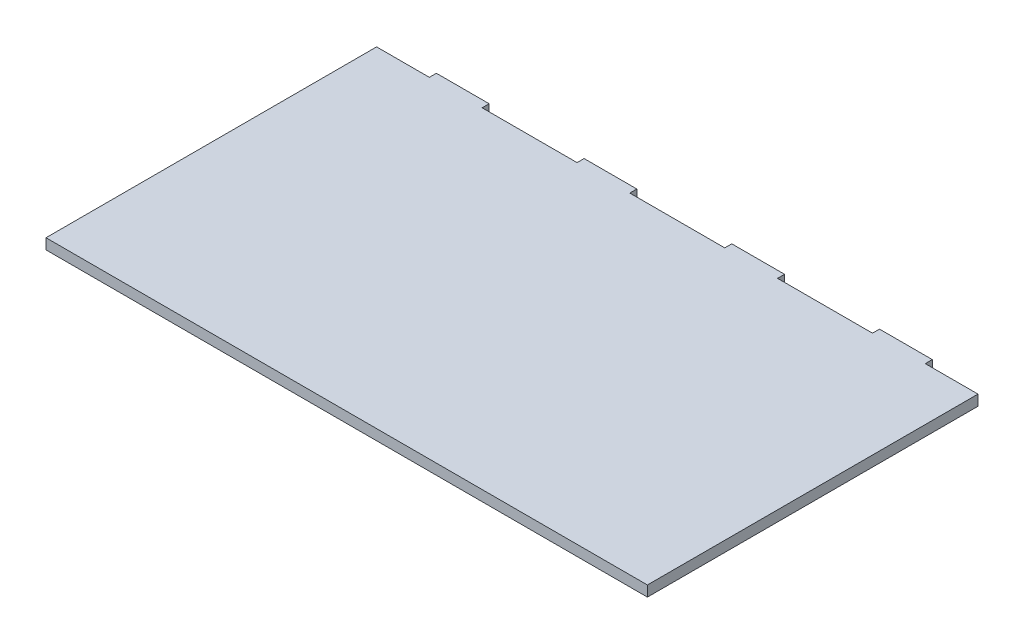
from build123d import *

# Parameters (mm, degrees)
SKETCH1_W           = 342
SKETCH1_H           = 188
SKETCH1_W_2         = 30
SKETCH1_H_2         = 4
BOSS_EXTRUDE1_DEPTH = 6


with BuildPart() as part:
    # Sketch1 → Boss-Extrude1 (new body)
    with BuildSketch(Plane(origin=(0, 0, 0), x_dir=(1, 0, 0), z_dir=(0, 1, 0))):
        with Locations((171, -94)):
            Rectangle(SKETCH1_W, SKETCH1_H)
        with Locations((45, 2)):
            Rectangle(SKETCH1_W_2, SKETCH1_H_2)
        with Locations((129, 2)):
            Rectangle(SKETCH1_W_2, SKETCH1_H_2)
        with Locations((297, 2)):
            Rectangle(SKETCH1_W_2, SKETCH1_H_2)
        with Locations((213, 2)):
            Rectangle(SKETCH1_W_2, SKETCH1_H_2)
    extrude(amount=BOSS_EXTRUDE1_DEPTH)


solid = part.part
